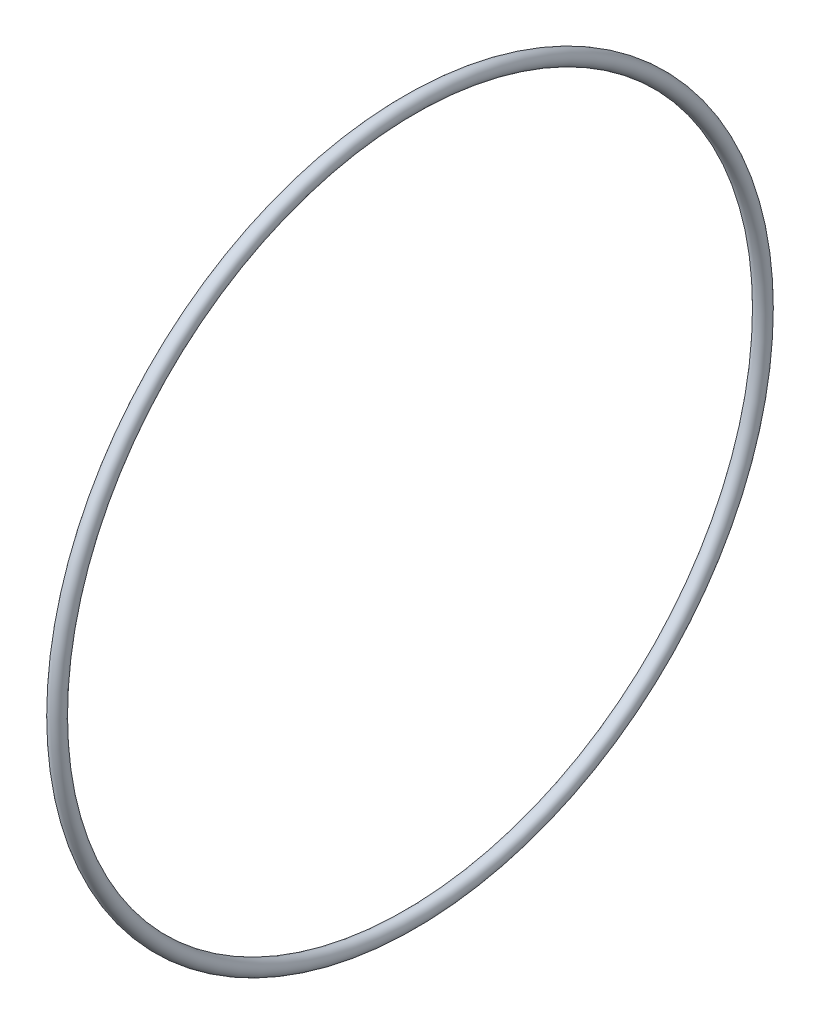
ISO-10303-21;
HEADER;
FILE_DESCRIPTION(('STEP AP214'),'2;1');
FILE_NAME('part.step','',(''),(''),'','','');
FILE_SCHEMA(('AUTOMOTIVE_DESIGN { 1 0 10303 214 1 1 1 1 }'));
ENDSEC;
DATA;
#1=APPLICATION_CONTEXT('core data for automotive mechanical design processes');
#2=APPLICATION_PROTOCOL_DEFINITION('international standard','automotive_design',2000,#1);
#3=PRODUCT_CONTEXT('',#1,'mechanical');
#4=PRODUCT('Part','Part','',(#3));
#5=PRODUCT_RELATED_PRODUCT_CATEGORY('part','',(#4));
#6=PRODUCT_DEFINITION_FORMATION('','',#4);
#7=PRODUCT_DEFINITION_CONTEXT('part definition',#1,'design');
#8=PRODUCT_DEFINITION('design','',#6,#7);
#9=PRODUCT_DEFINITION_SHAPE('','',#8);
#10=(LENGTH_UNIT() NAMED_UNIT(*) SI_UNIT(.MILLI.,.METRE.));
#11=(NAMED_UNIT(*) PLANE_ANGLE_UNIT() SI_UNIT($,.RADIAN.));
#12=(NAMED_UNIT(*) SI_UNIT($,.STERADIAN.) SOLID_ANGLE_UNIT());
#13=UNCERTAINTY_MEASURE_WITH_UNIT(LENGTH_MEASURE(1.E-05),#10,'distance_accuracy_value','');
#14=(GEOMETRIC_REPRESENTATION_CONTEXT(3) GLOBAL_UNCERTAINTY_ASSIGNED_CONTEXT((#13)) GLOBAL_UNIT_ASSIGNED_CONTEXT((#10,
#11,#12)) REPRESENTATION_CONTEXT('',''));
#15=CARTESIAN_POINT('',(0.,0.,0.));
#16=DIRECTION('',(0.,0.,1.));
#17=DIRECTION('',(1.,0.,0.));
#18=AXIS2_PLACEMENT_3D('',#15,#16,#17);
#19=CARTESIAN_POINT('',(0.,0.,0.));
#20=DIRECTION('',(1.,0.,0.));
#21=DIRECTION('',(0.,0.,-1.));
#22=AXIS2_PLACEMENT_3D('',#19,#20,#21);
#23=TOROIDAL_SURFACE('',#22,16.75,0.35);
#24=CARTESIAN_POINT('',(0.,0.,-17.1));
#25=VERTEX_POINT('',#24);
#26=VERTEX_LOOP('',#25);
#27=FACE_BOUND('',#26,.T.);
#28=ADVANCED_FACE('F27',(#27),#23,.T.);
#29=CLOSED_SHELL('',(#28));
#30=MANIFOLD_SOLID_BREP('B2',#29);
#31=ADVANCED_BREP_SHAPE_REPRESENTATION('',(#18,#30),#14);
#32=SHAPE_DEFINITION_REPRESENTATION(#9,#31);
ENDSEC;
END-ISO-10303-21;
